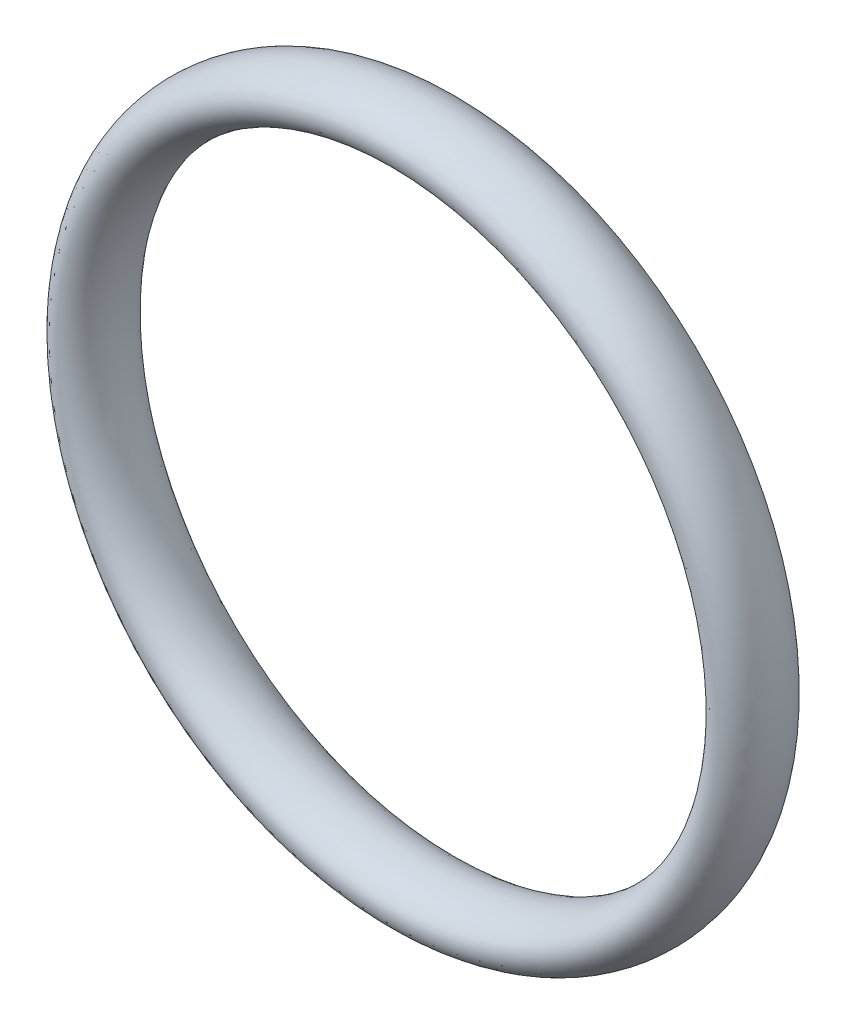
from build123d import *

# Parameters (mm, degrees)
ESQUISSE1_RX = 1.35
ESQUISSE1_RY = 0.925


with BuildPart() as part:
    # Esquisse1 → Base-R_volution (revolve)
    with BuildSketch(Plane(origin=(0, 0, 0), x_dir=(0, 0, -1), z_dir=(1, 0, 0))):
        with Locations((1.35, 11.575)):
            Ellipse(ESQUISSE1_RX, ESQUISSE1_RY)
    revolve(axis=Axis((0, 0, 0), (0, 0, -1)))


solid = part.part
